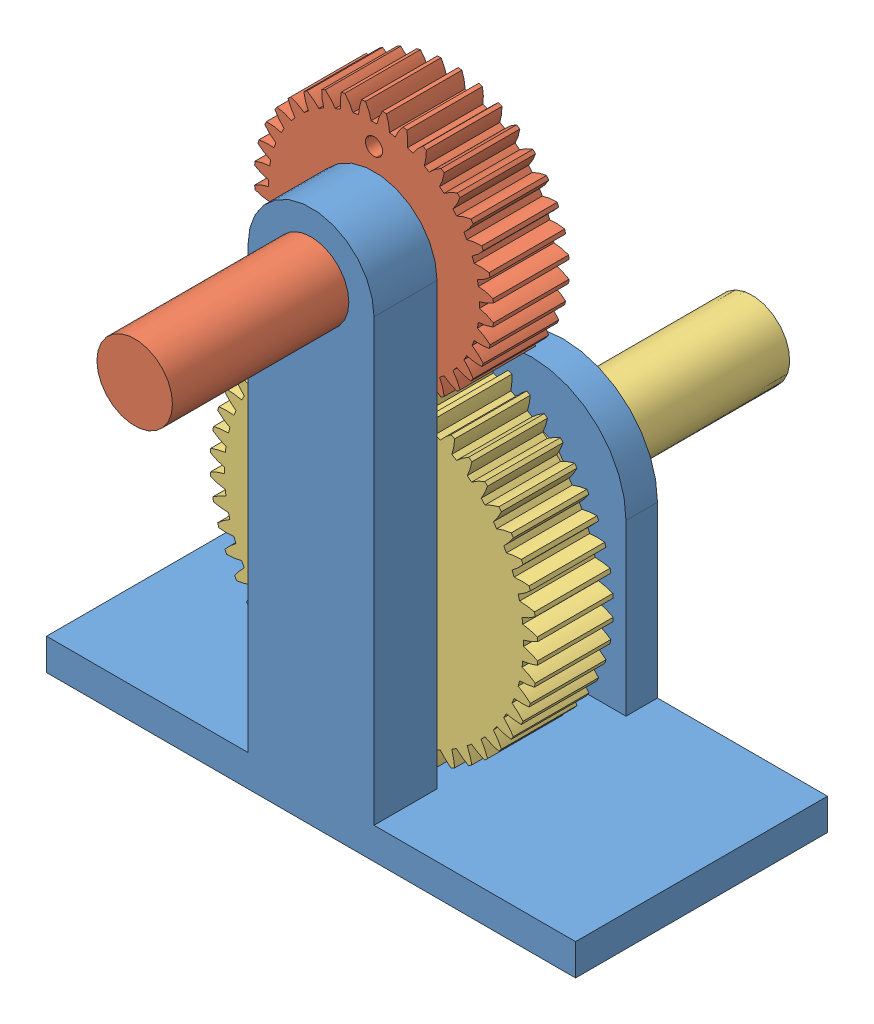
SolidWorks assembly reducteurext.SLDASM, configuration Défaut (file format 6000). Lengths in mm.
Overall size (84 93.86 98).
3 component instances, 3 part files, 4 mates.
Components (placement in the parent):
- bati1-1: bati1.SLDPRT [Défaut] at (-10.5991 2.8059 0) size (84 84.91 40)
- pignon1(36)-1: pignon1(36).SLDPRT [Défaut] at (-10.5991 2.8059 0) x (0 0 -1) z (1 0 0) size (50 37.9 37.9)
- pignon2(50)-1: pignon2(50).SLDPRT [Metric - Spur gear 1M 50T 20PA 12FW ---S50N75H50L0.8N] at (-10.5991 -40.1941 -12) x (0 0 1) z (-0.982351 -0.187044 0) size (60 51.93 52)
Mates (geometry in assembly coordinates):
- Coaxiale1: concentric aligned: cylinder of pignon1(36)-1 through (-10.5991 2.8059 38) axis (0 0 -1) radius 6; cylinder of bati1-1 through (-10.5991 2.8059 10) axis (0 0 -1) radius 6
- Coïncidente1: coincident anti-aligned: plane of bati1-1 through (-10.5991 2.8059 0) normal (0 0 -1); plane of pignon1(36)-1 through (-10.5991 2.8059 0) normal (0 0 1)
- Coaxiale2: concentric anti-aligned: cylinder of bati1-1 through (-10.5991 -40.1941 30.6839) axis (0 0 -1) radius 6; cylinder of pignon2(50)-1 through (-10.5991 -40.1941 -60) axis (0 0 1) radius 6
- Coïncidente2: coincident anti-aligned: plane of bati1-1 through (-10.5991 2.8059 0) normal (0 0 -1); plane of pignon2(50)-1 through (-10.5991 -40.1941 0) normal (0 0 1)
